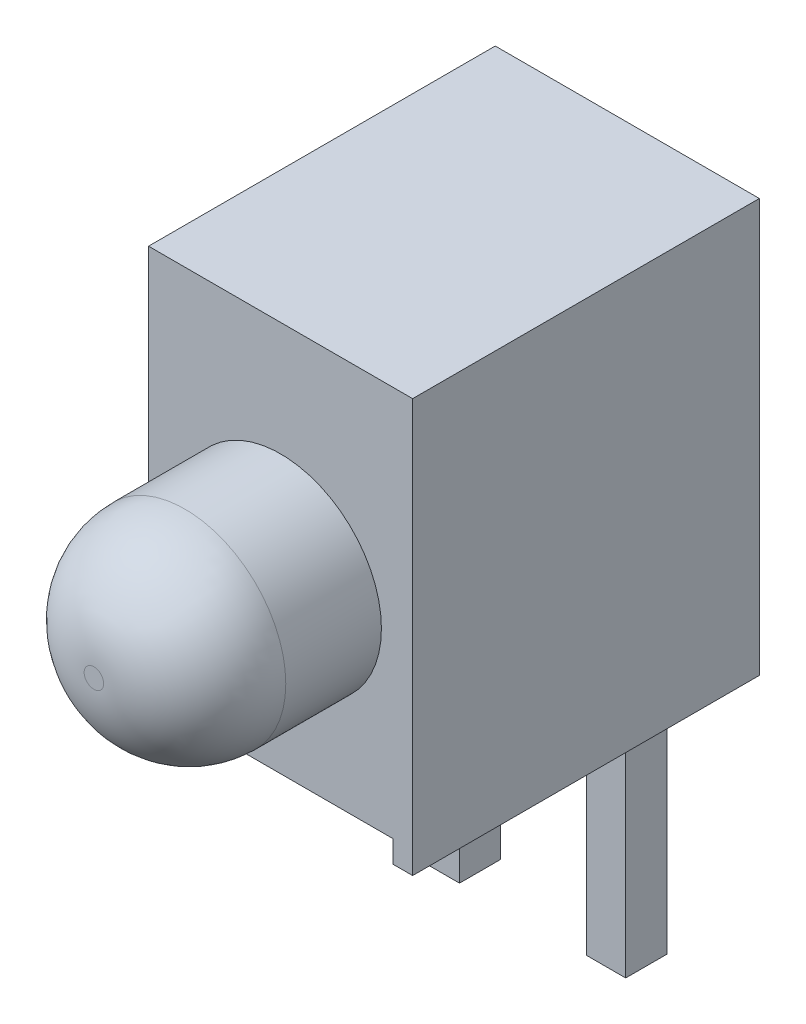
ISO-10303-21;
HEADER;
FILE_DESCRIPTION(('STEP AP214'),'2;1');
FILE_NAME('part.step','',(''),(''),'','','');
FILE_SCHEMA(('AUTOMOTIVE_DESIGN { 1 0 10303 214 1 1 1 1 }'));
ENDSEC;
DATA;
#1=APPLICATION_CONTEXT('core data for automotive mechanical design processes');
#2=APPLICATION_PROTOCOL_DEFINITION('international standard','automotive_design',2000,#1);
#3=PRODUCT_CONTEXT('',#1,'mechanical');
#4=PRODUCT('Part','Part','',(#3));
#5=PRODUCT_RELATED_PRODUCT_CATEGORY('part','',(#4));
#6=PRODUCT_DEFINITION_FORMATION('','',#4);
#7=PRODUCT_DEFINITION_CONTEXT('part definition',#1,'design');
#8=PRODUCT_DEFINITION('design','',#6,#7);
#9=PRODUCT_DEFINITION_SHAPE('','',#8);
#10=(LENGTH_UNIT() NAMED_UNIT(*) SI_UNIT(.MILLI.,.METRE.));
#11=(NAMED_UNIT(*) PLANE_ANGLE_UNIT() SI_UNIT($,.RADIAN.));
#12=(NAMED_UNIT(*) SI_UNIT($,.STERADIAN.) SOLID_ANGLE_UNIT());
#13=UNCERTAINTY_MEASURE_WITH_UNIT(LENGTH_MEASURE(1.E-05),#10,'distance_accuracy_value','');
#14=(GEOMETRIC_REPRESENTATION_CONTEXT(3) GLOBAL_UNCERTAINTY_ASSIGNED_CONTEXT((#13)) GLOBAL_UNIT_ASSIGNED_CONTEXT((#10,
#11,#12)) REPRESENTATION_CONTEXT('',''));
#15=CARTESIAN_POINT('',(0.,0.,0.));
#16=DIRECTION('',(0.,0.,1.));
#17=DIRECTION('',(1.,0.,0.));
#18=AXIS2_PLACEMENT_3D('',#15,#16,#17);
#19=CARTESIAN_POINT('',(-1.76265219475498,0.340679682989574,-2.665));
#20=DIRECTION('',(0.,1.,0.));
#21=DIRECTION('',(0.,0.,1.));
#22=AXIS2_PLACEMENT_3D('',#19,#20,#21);
#23=PLANE('',#22);
#24=DIRECTION('',(0.,0.,1.));
#25=VECTOR('',#24,1.);
#26=CARTESIAN_POINT('',(-0.978193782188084,0.340679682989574,-1.06361068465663));
#27=LINE('',#26,#25);
#28=CARTESIAN_POINT('',(-0.978193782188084,0.340679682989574,-1.69638974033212));
#29=VERTEX_POINT('',#28);
#30=CARTESIAN_POINT('',(-0.978193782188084,0.340679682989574,-1.06361068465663));
#31=VERTEX_POINT('',#30);
#32=EDGE_CURVE('E166',#29,#31,#27,.T.);
#33=ORIENTED_EDGE('',*,*,#32,.F.);
#34=DIRECTION('',(1.,0.,0.));
#35=VECTOR('',#34,1.);
#36=CARTESIAN_POINT('',(-1.57819378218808,0.340679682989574,-1.69638974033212));
#37=LINE('',#36,#35);
#38=CARTESIAN_POINT('',(-1.57819378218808,0.340679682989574,-1.69638974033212));
#39=VERTEX_POINT('',#38);
#40=EDGE_CURVE('E179',#39,#29,#37,.T.);
#41=ORIENTED_EDGE('',*,*,#40,.F.);
#42=DIRECTION('',(0.,0.,-1.));
#43=VECTOR('',#42,1.);
#44=CARTESIAN_POINT('',(-1.57819378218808,0.340679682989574,-1.06361068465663));
#45=LINE('',#44,#43);
#46=CARTESIAN_POINT('',(-1.57819378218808,0.340679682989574,-1.06361068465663));
#47=VERTEX_POINT('',#46);
#48=EDGE_CURVE('E188',#47,#39,#45,.T.);
#49=ORIENTED_EDGE('',*,*,#48,.F.);
#50=DIRECTION('',(-1.,0.,0.));
#51=VECTOR('',#50,1.);
#52=CARTESIAN_POINT('',(-1.57819378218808,0.340679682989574,-1.06361068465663));
#53=LINE('',#52,#51);
#54=EDGE_CURVE('E169',#31,#47,#53,.T.);
#55=ORIENTED_EDGE('',*,*,#54,.F.);
#56=EDGE_LOOP('',(#33,#41,#49,#55));
#57=FACE_BOUND('',#56,.T.);
#58=DIRECTION('',(-1.,0.,0.));
#59=VECTOR('',#58,1.);
#60=CARTESIAN_POINT('',(-1.76265219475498,0.340679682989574,2.665));
#61=LINE('',#60,#59);
#62=CARTESIAN_POINT('',(1.73117626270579,0.340679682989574,2.665));
#63=VERTEX_POINT('',#62);
#64=CARTESIAN_POINT('',(-1.76265219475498,0.340679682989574,2.665));
#65=VERTEX_POINT('',#64);
#66=EDGE_CURVE('E209',#63,#65,#61,.T.);
#67=ORIENTED_EDGE('',*,*,#66,.T.);
#68=DIRECTION('',(0.,0.,1.));
#69=VECTOR('',#68,1.);
#70=CARTESIAN_POINT('',(-1.76265219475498,0.340679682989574,-2.665));
#71=LINE('',#70,#69);
#72=CARTESIAN_POINT('',(-1.76265219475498,0.340679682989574,-2.665));
#73=VERTEX_POINT('',#72);
#74=EDGE_CURVE('E222',#73,#65,#71,.T.);
#75=ORIENTED_EDGE('',*,*,#74,.F.);
#76=DIRECTION('',(-1.,0.,0.));
#77=VECTOR('',#76,1.);
#78=CARTESIAN_POINT('',(-1.76265219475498,0.340679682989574,-2.665));
#79=LINE('',#78,#77);
#80=CARTESIAN_POINT('',(1.73117626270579,0.340679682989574,-2.665));
#81=VERTEX_POINT('',#80);
#82=EDGE_CURVE('E212',#81,#73,#79,.T.);
#83=ORIENTED_EDGE('',*,*,#82,.F.);
#84=DIRECTION('',(0.,0.,1.));
#85=VECTOR('',#84,1.);
#86=CARTESIAN_POINT('',(1.73117626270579,0.340679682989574,-2.665));
#87=LINE('',#86,#85);
#88=EDGE_CURVE('E225',#81,#63,#87,.T.);
#89=ORIENTED_EDGE('',*,*,#88,.T.);
#90=EDGE_LOOP('',(#67,#75,#83,#89));
#91=FACE_BOUND('',#90,.T.);
#92=DIRECTION('',(0.,0.,1.));
#93=VECTOR('',#92,1.);
#94=CARTESIAN_POINT('',(1.56180621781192,0.340679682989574,-1.07861047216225));
#95=LINE('',#94,#93);
#96=CARTESIAN_POINT('',(1.56180621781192,0.340679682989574,-1.71138952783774));
#97=VERTEX_POINT('',#96);
#98=CARTESIAN_POINT('',(1.56180621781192,0.340679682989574,-1.07861047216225));
#99=VERTEX_POINT('',#98);
#100=EDGE_CURVE('E165',#97,#99,#95,.T.);
#101=ORIENTED_EDGE('',*,*,#100,.F.);
#102=DIRECTION('',(1.,0.,0.));
#103=VECTOR('',#102,1.);
#104=CARTESIAN_POINT('',(0.961806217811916,0.340679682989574,-1.71138952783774));
#105=LINE('',#104,#103);
#106=CARTESIAN_POINT('',(0.961806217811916,0.340679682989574,-1.71138952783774));
#107=VERTEX_POINT('',#106);
#108=EDGE_CURVE('E162',#107,#97,#105,.T.);
#109=ORIENTED_EDGE('',*,*,#108,.F.);
#110=DIRECTION('',(0.,0.,-1.));
#111=VECTOR('',#110,1.);
#112=CARTESIAN_POINT('',(0.961806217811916,0.340679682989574,-1.07861047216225));
#113=LINE('',#112,#111);
#114=CARTESIAN_POINT('',(0.961806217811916,0.340679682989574,-1.07861047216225));
#115=VERTEX_POINT('',#114);
#116=EDGE_CURVE('E52',#115,#107,#113,.T.);
#117=ORIENTED_EDGE('',*,*,#116,.F.);
#118=DIRECTION('',(-1.,0.,0.));
#119=VECTOR('',#118,1.);
#120=CARTESIAN_POINT('',(0.961806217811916,0.340679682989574,-1.07861047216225));
#121=LINE('',#120,#119);
#122=EDGE_CURVE('E47',#99,#115,#121,.T.);
#123=ORIENTED_EDGE('',*,*,#122,.F.);
#124=EDGE_LOOP('',(#101,#109,#117,#123));
#125=FACE_BOUND('',#124,.T.);
#126=ADVANCED_FACE('F32',(#57,#91,#125),#23,.F.);
#127=CARTESIAN_POINT('',(2.03,0.,2.665));
#128=DIRECTION('',(0.,1.,0.));
#129=DIRECTION('',(0.,0.,1.));
#130=AXIS2_PLACEMENT_3D('',#127,#128,#129);
#131=PLANE('',#130);
#132=DIRECTION('',(-1.,0.,0.));
#133=VECTOR('',#132,1.);
#134=CARTESIAN_POINT('',(-2.03,0.,-2.665));
#135=LINE('',#134,#133);
#136=CARTESIAN_POINT('',(-1.76265219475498,0.,-2.665));
#137=VERTEX_POINT('',#136);
#138=CARTESIAN_POINT('',(-2.03,0.,-2.665));
#139=VERTEX_POINT('',#138);
#140=EDGE_CURVE('E244',#137,#139,#135,.T.);
#141=ORIENTED_EDGE('',*,*,#140,.F.);
#142=DIRECTION('',(0.,0.,1.));
#143=VECTOR('',#142,1.);
#144=CARTESIAN_POINT('',(-1.76265219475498,0.,-2.665));
#145=LINE('',#144,#143);
#146=CARTESIAN_POINT('',(-1.76265219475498,0.,2.665));
#147=VERTEX_POINT('',#146);
#148=EDGE_CURVE('E215',#137,#147,#145,.T.);
#149=ORIENTED_EDGE('',*,*,#148,.T.);
#150=DIRECTION('',(1.,0.,0.));
#151=VECTOR('',#150,1.);
#152=CARTESIAN_POINT('',(-2.03,0.,2.665));
#153=LINE('',#152,#151);
#154=CARTESIAN_POINT('',(-2.03,0.,2.665));
#155=VERTEX_POINT('',#154);
#156=EDGE_CURVE('E235',#155,#147,#153,.T.);
#157=ORIENTED_EDGE('',*,*,#156,.F.);
#158=DIRECTION('',(0.,0.,1.));
#159=VECTOR('',#158,1.);
#160=CARTESIAN_POINT('',(-2.03,0.,-2.665));
#161=LINE('',#160,#159);
#162=EDGE_CURVE('E248',#139,#155,#161,.T.);
#163=ORIENTED_EDGE('',*,*,#162,.F.);
#164=EDGE_LOOP('',(#141,#149,#157,#163));
#165=FACE_BOUND('',#164,.T.);
#166=ADVANCED_FACE('F285',(#165),#131,.F.);
#167=CARTESIAN_POINT('',(-2.03,6.35,2.665));
#168=DIRECTION('',(0.,0.,-1.));
#169=DIRECTION('',(-1.,0.,0.));
#170=AXIS2_PLACEMENT_3D('',#167,#168,#169);
#171=PLANE('',#170);
#172=ORIENTED_EDGE('',*,*,#156,.T.);
#173=DIRECTION('',(0.,-1.,0.));
#174=VECTOR('',#173,1.);
#175=CARTESIAN_POINT('',(-1.76265219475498,0.,2.665));
#176=LINE('',#175,#174);
#177=EDGE_CURVE('E204',#65,#147,#176,.T.);
#178=ORIENTED_EDGE('',*,*,#177,.F.);
#179=ORIENTED_EDGE('',*,*,#66,.F.);
#180=DIRECTION('',(0.,1.,0.));
#181=VECTOR('',#180,1.);
#182=CARTESIAN_POINT('',(1.73117626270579,0.,2.665));
#183=LINE('',#182,#181);
#184=CARTESIAN_POINT('',(1.73117626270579,0.,2.665));
#185=VERTEX_POINT('',#184);
#186=EDGE_CURVE('E217',#185,#63,#183,.T.);
#187=ORIENTED_EDGE('',*,*,#186,.F.);
#188=CARTESIAN_POINT('',(2.03,0.,2.665));
#189=VERTEX_POINT('',#188);
#190=EDGE_CURVE('E250',#185,#189,#153,.T.);
#191=ORIENTED_EDGE('',*,*,#190,.T.);
#192=DIRECTION('',(0.,-1.,0.));
#193=VECTOR('',#192,1.);
#194=CARTESIAN_POINT('',(2.03,6.35,2.665));
#195=LINE('',#194,#193);
#196=CARTESIAN_POINT('',(2.03,6.35,2.665));
#197=VERTEX_POINT('',#196);
#198=EDGE_CURVE('E241',#197,#189,#195,.T.);
#199=ORIENTED_EDGE('',*,*,#198,.F.);
#200=DIRECTION('',(1.,0.,0.));
#201=VECTOR('',#200,1.);
#202=CARTESIAN_POINT('',(-2.03,6.35,2.665));
#203=LINE('',#202,#201);
#204=CARTESIAN_POINT('',(-2.03,6.35,2.665));
#205=VERTEX_POINT('',#204);
#206=EDGE_CURVE('E239',#205,#197,#203,.T.);
#207=ORIENTED_EDGE('',*,*,#206,.F.);
#208=DIRECTION('',(0.,-1.,0.));
#209=VECTOR('',#208,1.);
#210=CARTESIAN_POINT('',(-2.03,6.35,2.665));
#211=LINE('',#210,#209);
#212=EDGE_CURVE('E255',#205,#155,#211,.T.);
#213=ORIENTED_EDGE('',*,*,#212,.T.);
#214=EDGE_LOOP('',(#172,#178,#179,#187,#191,#199,#207,#213));
#215=FACE_BOUND('',#214,.T.);
#216=CARTESIAN_POINT('',(0.,3.05,2.665));
#217=DIRECTION('',(0.,0.,-1.));
#218=DIRECTION('',(-1.,0.,0.));
#219=AXIS2_PLACEMENT_3D('',#216,#217,#218);
#220=CIRCLE('',#219,1.55);
#221=CARTESIAN_POINT('',(-1.55,3.05,2.665));
#222=VERTEX_POINT('',#221);
#223=EDGE_CURVE('E264',#222,#222,#220,.F.);
#224=ORIENTED_EDGE('',*,*,#223,.F.);
#225=EDGE_LOOP('',(#224));
#226=FACE_BOUND('',#225,.T.);
#227=ADVANCED_FACE('F291',(#215,#226),#171,.F.);
#228=CARTESIAN_POINT('',(2.03,6.35,-2.665));
#229=DIRECTION('',(-1.,0.,0.));
#230=DIRECTION('',(0.,0.,1.));
#231=AXIS2_PLACEMENT_3D('',#228,#229,#230);
#232=PLANE('',#231);
#233=DIRECTION('',(0.,0.,-1.));
#234=VECTOR('',#233,1.);
#235=CARTESIAN_POINT('',(2.03,0.,-2.665));
#236=LINE('',#235,#234);
#237=CARTESIAN_POINT('',(2.03,0.,-2.665));
#238=VERTEX_POINT('',#237);
#239=EDGE_CURVE('E224',#189,#238,#236,.T.);
#240=ORIENTED_EDGE('',*,*,#239,.T.);
#241=DIRECTION('',(0.,-1.,0.));
#242=VECTOR('',#241,1.);
#243=CARTESIAN_POINT('',(2.03,6.35,-2.665));
#244=LINE('',#243,#242);
#245=CARTESIAN_POINT('',(2.03,6.35,-2.665));
#246=VERTEX_POINT('',#245);
#247=EDGE_CURVE('E261',#246,#238,#244,.T.);
#248=ORIENTED_EDGE('',*,*,#247,.F.);
#249=DIRECTION('',(0.,0.,-1.));
#250=VECTOR('',#249,1.);
#251=CARTESIAN_POINT('',(2.03,6.35,-2.665));
#252=LINE('',#251,#250);
#253=EDGE_CURVE('E231',#197,#246,#252,.T.);
#254=ORIENTED_EDGE('',*,*,#253,.F.);
#255=ORIENTED_EDGE('',*,*,#198,.T.);
#256=EDGE_LOOP('',(#240,#248,#254,#255));
#257=FACE_BOUND('',#256,.T.);
#258=ADVANCED_FACE('F315',(#257),#232,.F.);
#259=CARTESIAN_POINT('',(-2.03,6.35,-2.665));
#260=DIRECTION('',(0.,0.,1.));
#261=DIRECTION('',(1.,0.,0.));
#262=AXIS2_PLACEMENT_3D('',#259,#260,#261);
#263=PLANE('',#262);
#264=ORIENTED_EDGE('',*,*,#82,.T.);
#265=DIRECTION('',(0.,-1.,0.));
#266=VECTOR('',#265,1.);
#267=CARTESIAN_POINT('',(-1.76265219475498,0.,-2.665));
#268=LINE('',#267,#266);
#269=EDGE_CURVE('E205',#73,#137,#268,.T.);
#270=ORIENTED_EDGE('',*,*,#269,.T.);
#271=ORIENTED_EDGE('',*,*,#140,.T.);
#272=DIRECTION('',(0.,-1.,0.));
#273=VECTOR('',#272,1.);
#274=CARTESIAN_POINT('',(-2.03,6.35,-2.665));
#275=LINE('',#274,#273);
#276=CARTESIAN_POINT('',(-2.03,6.35,-2.665));
#277=VERTEX_POINT('',#276);
#278=EDGE_CURVE('E258',#277,#139,#275,.T.);
#279=ORIENTED_EDGE('',*,*,#278,.F.);
#280=DIRECTION('',(-1.,0.,0.));
#281=VECTOR('',#280,1.);
#282=CARTESIAN_POINT('',(-2.03,6.35,-2.665));
#283=LINE('',#282,#281);
#284=EDGE_CURVE('E234',#246,#277,#283,.T.);
#285=ORIENTED_EDGE('',*,*,#284,.F.);
#286=ORIENTED_EDGE('',*,*,#247,.T.);
#287=CARTESIAN_POINT('',(1.73117626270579,0.,-2.665));
#288=VERTEX_POINT('',#287);
#289=EDGE_CURVE('E245',#238,#288,#135,.T.);
#290=ORIENTED_EDGE('',*,*,#289,.T.);
#291=DIRECTION('',(0.,1.,0.));
#292=VECTOR('',#291,1.);
#293=CARTESIAN_POINT('',(1.73117626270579,0.,-2.665));
#294=LINE('',#293,#292);
#295=EDGE_CURVE('E208',#288,#81,#294,.T.);
#296=ORIENTED_EDGE('',*,*,#295,.T.);
#297=EDGE_LOOP('',(#264,#270,#271,#279,#285,#286,#290,#296));
#298=FACE_BOUND('',#297,.T.);
#299=ADVANCED_FACE('F319',(#298),#263,.F.);
#300=CARTESIAN_POINT('',(-2.03,6.35,-2.665));
#301=DIRECTION('',(1.,0.,0.));
#302=DIRECTION('',(0.,0.,-1.));
#303=AXIS2_PLACEMENT_3D('',#300,#301,#302);
#304=PLANE('',#303);
#305=ORIENTED_EDGE('',*,*,#162,.T.);
#306=ORIENTED_EDGE('',*,*,#212,.F.);
#307=DIRECTION('',(0.,0.,1.));
#308=VECTOR('',#307,1.);
#309=CARTESIAN_POINT('',(-2.03,6.35,-2.665));
#310=LINE('',#309,#308);
#311=EDGE_CURVE('E237',#277,#205,#310,.T.);
#312=ORIENTED_EDGE('',*,*,#311,.F.);
#313=ORIENTED_EDGE('',*,*,#278,.T.);
#314=EDGE_LOOP('',(#305,#306,#312,#313));
#315=FACE_BOUND('',#314,.T.);
#316=ADVANCED_FACE('F308',(#315),#304,.F.);
#317=CARTESIAN_POINT('',(2.03,6.35,2.665));
#318=DIRECTION('',(0.,1.,0.));
#319=DIRECTION('',(0.,0.,1.));
#320=AXIS2_PLACEMENT_3D('',#317,#318,#319);
#321=PLANE('',#320);
#322=ORIENTED_EDGE('',*,*,#253,.T.);
#323=ORIENTED_EDGE('',*,*,#284,.T.);
#324=ORIENTED_EDGE('',*,*,#311,.T.);
#325=ORIENTED_EDGE('',*,*,#206,.T.);
#326=EDGE_LOOP('',(#322,#323,#324,#325));
#327=FACE_BOUND('',#326,.T.);
#328=ADVANCED_FACE('F306',(#327),#321,.T.);
#329=ORIENTED_EDGE('',*,*,#190,.F.);
#330=DIRECTION('',(0.,0.,1.));
#331=VECTOR('',#330,1.);
#332=CARTESIAN_POINT('',(1.73117626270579,0.,-2.665));
#333=LINE('',#332,#331);
#334=EDGE_CURVE('E227',#288,#185,#333,.T.);
#335=ORIENTED_EDGE('',*,*,#334,.F.);
#336=ORIENTED_EDGE('',*,*,#289,.F.);
#337=ORIENTED_EDGE('',*,*,#239,.F.);
#338=EDGE_LOOP('',(#329,#335,#336,#337));
#339=FACE_BOUND('',#338,.T.);
#340=ADVANCED_FACE('F294',(#339),#131,.F.);
#341=CARTESIAN_POINT('',(0.,3.05,5.5352));
#342=DIRECTION('',(0.,0.,-1.));
#343=DIRECTION('',(-1.,0.,0.));
#344=AXIS2_PLACEMENT_3D('',#341,#342,#343);
#345=CYLINDRICAL_SURFACE('',#344,1.55);
#346=CARTESIAN_POINT('',(0.,3.05,4.1352));
#347=DIRECTION('',(0.,0.,1.));
#348=DIRECTION('',(1.,0.,0.));
#349=AXIS2_PLACEMENT_3D('',#346,#347,#348);
#350=CIRCLE('',#349,1.55);
#351=CARTESIAN_POINT('',(-1.55,3.05,4.1352));
#352=VERTEX_POINT('',#351);
#353=EDGE_CURVE('E11',#352,#352,#350,.F.);
#354=CARTESIAN_POINT('',(-1.55,3.05,4.1352));
#355=CARTESIAN_POINT('',(-1.55,3.05,4.11988541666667));
#356=CARTESIAN_POINT('',(-1.55,3.05,4.10457083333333));
#357=CARTESIAN_POINT('',(-1.55,3.05,4.07394166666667));
#358=CARTESIAN_POINT('',(-1.55,3.05,4.05862708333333));
#359=CARTESIAN_POINT('',(-1.55,3.05,4.02799791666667));
#360=CARTESIAN_POINT('',(-1.55,3.05,4.01268333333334));
#361=CARTESIAN_POINT('',(-1.55,3.05,3.98205416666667));
#362=CARTESIAN_POINT('',(-1.55,3.05,3.96673958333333));
#363=CARTESIAN_POINT('',(-1.55,3.05,3.93611041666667));
#364=CARTESIAN_POINT('',(-1.55,3.05,3.92079583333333));
#365=CARTESIAN_POINT('',(-1.55,3.05,3.89016666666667));
#366=CARTESIAN_POINT('',(-1.55,3.05,3.87485208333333));
#367=CARTESIAN_POINT('',(-1.55,3.05,3.84422291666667));
#368=CARTESIAN_POINT('',(-1.55,3.05,3.82890833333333));
#369=CARTESIAN_POINT('',(-1.55,3.05,3.79827916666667));
#370=CARTESIAN_POINT('',(-1.55,3.05,3.78296458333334));
#371=CARTESIAN_POINT('',(-1.55,3.05,3.75233541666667));
#372=CARTESIAN_POINT('',(-1.55,3.05,3.73702083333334));
#373=CARTESIAN_POINT('',(-1.55,3.05,3.70639166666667));
#374=CARTESIAN_POINT('',(-1.55,3.05,3.69107708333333));
#375=CARTESIAN_POINT('',(-1.55,3.05,3.66044791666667));
#376=CARTESIAN_POINT('',(-1.55,3.05,3.64513333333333));
#377=CARTESIAN_POINT('',(-1.55,3.05,3.61450416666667));
#378=CARTESIAN_POINT('',(-1.55,3.05,3.59918958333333));
#379=CARTESIAN_POINT('',(-1.55,3.05,3.56856041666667));
#380=CARTESIAN_POINT('',(-1.55,3.05,3.55324583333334));
#381=CARTESIAN_POINT('',(-1.55,3.05,3.52261666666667));
#382=CARTESIAN_POINT('',(-1.55,3.05,3.50730208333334));
#383=CARTESIAN_POINT('',(-1.55,3.05,3.47667291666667));
#384=CARTESIAN_POINT('',(-1.55,3.05,3.46135833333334));
#385=CARTESIAN_POINT('',(-1.55,3.05,3.43072916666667));
#386=CARTESIAN_POINT('',(-1.55,3.05,3.41541458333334));
#387=CARTESIAN_POINT('',(-1.55,3.05,3.38478541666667));
#388=CARTESIAN_POINT('',(-1.55,3.05,3.36947083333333));
#389=CARTESIAN_POINT('',(-1.55,3.05,3.33884166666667));
#390=CARTESIAN_POINT('',(-1.55,3.05,3.32352708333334));
#391=CARTESIAN_POINT('',(-1.55,3.05,3.29289791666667));
#392=CARTESIAN_POINT('',(-1.55,3.05,3.27758333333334));
#393=CARTESIAN_POINT('',(-1.55,3.05,3.24695416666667));
#394=CARTESIAN_POINT('',(-1.55,3.05,3.23163958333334));
#395=CARTESIAN_POINT('',(-1.55,3.05,3.20101041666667));
#396=CARTESIAN_POINT('',(-1.55,3.05,3.18569583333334));
#397=CARTESIAN_POINT('',(-1.55,3.05,3.15506666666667));
#398=CARTESIAN_POINT('',(-1.55,3.05,3.13975208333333));
#399=CARTESIAN_POINT('',(-1.55,3.05,3.10912291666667));
#400=CARTESIAN_POINT('',(-1.55,3.05,3.09380833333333));
#401=CARTESIAN_POINT('',(-1.55,3.05,3.06317916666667));
#402=CARTESIAN_POINT('',(-1.55,3.05,3.04786458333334));
#403=CARTESIAN_POINT('',(-1.55,3.05,3.01723541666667));
#404=CARTESIAN_POINT('',(-1.55,3.05,3.00192083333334));
#405=CARTESIAN_POINT('',(-1.55,3.05,2.97129166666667));
#406=CARTESIAN_POINT('',(-1.55,3.05,2.95597708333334));
#407=CARTESIAN_POINT('',(-1.55,3.05,2.92534791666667));
#408=CARTESIAN_POINT('',(-1.55,3.05,2.91003333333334));
#409=CARTESIAN_POINT('',(-1.55,3.05,2.87940416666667));
#410=CARTESIAN_POINT('',(-1.55,3.05,2.86408958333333));
#411=CARTESIAN_POINT('',(-1.55,3.05,2.83346041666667));
#412=CARTESIAN_POINT('',(-1.55,3.05,2.81814583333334));
#413=CARTESIAN_POINT('',(-1.55,3.05,2.78751666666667));
#414=CARTESIAN_POINT('',(-1.55,3.05,2.77220208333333));
#415=CARTESIAN_POINT('',(-1.55,3.05,2.74157291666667));
#416=CARTESIAN_POINT('',(-1.55,3.05,2.72625833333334));
#417=CARTESIAN_POINT('',(-1.55,3.05,2.69562916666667));
#418=CARTESIAN_POINT('',(-1.55,3.05,2.68031458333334));
#419=CARTESIAN_POINT('',(-1.55,3.05,2.665));
#420=B_SPLINE_CURVE_WITH_KNOTS('',3,(#354,#355,#356,#357,#358,#359,#360,#361,#362,#363,#364,
#365,#366,#367,#368,#369,#370,#371,#372,#373,#374,#375,#376,#377,#378,#379,#380,#381,#382,#383,
#384,#385,#386,#387,#388,#389,#390,#391,#392,#393,#394,#395,#396,#397,#398,#399,#400,#401,#402,
#403,#404,#405,#406,#407,#408,#409,#410,#411,#412,#413,#414,#415,#416,#417,#418,#419),
.UNSPECIFIED.,.F.,.F.,(4,2,2,2,2,2,2,2,2,2,2,2,2,2,2,2,2,2,2,2,2,2,2,2,2,2,2,2,2,2,2,2,4),(0.,
0.0459437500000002,0.0918874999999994,0.13783125,0.183775,0.22971875,0.2756625,0.32160625,
0.367549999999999,0.41349375,0.4594375,0.50538125,0.551325,0.597268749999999,0.6432125,
0.689156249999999,0.735099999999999,0.781043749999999,0.826987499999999,0.872931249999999,
0.918874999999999,0.964818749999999,1.0107625,1.05670625,1.10265,1.14859375,1.1945375,
1.24048125,1.286425,1.33236875,1.3783125,1.42425625,1.4702),.UNSPECIFIED.);
#421=EDGE_CURVE('BSEAM281',#352,#222,#420,.T.);
#422=ORIENTED_EDGE('',*,*,#353,.T.);
#423=ORIENTED_EDGE('',*,*,#223,.T.);
#424=ORIENTED_EDGE('',*,*,#421,.T.);
#425=ORIENTED_EDGE('',*,*,#421,.F.);
#426=EDGE_LOOP('',(#422,#424,#423,#425));
#427=FACE_BOUND('',#426,.T.);
#428=ADVANCED_FACE('F281',(#427),#345,.T.);
#429=CARTESIAN_POINT('',(0.,3.05,5.5352));
#430=DIRECTION('',(0.,0.,1.));
#431=DIRECTION('',(1.,0.,0.));
#432=AXIS2_PLACEMENT_3D('',#429,#430,#431);
#433=PLANE('',#432);
#434=CARTESIAN_POINT('',(0.,3.05,5.5352));
#435=DIRECTION('',(0.,0.,1.));
#436=DIRECTION('',(1.,0.,0.));
#437=AXIS2_PLACEMENT_3D('',#434,#435,#436);
#438=CIRCLE('',#437,0.15);
#439=CARTESIAN_POINT('',(0.15,3.05,5.5352));
#440=VERTEX_POINT('',#439);
#441=EDGE_CURVE('E40',#440,#440,#438,.T.);
#442=ORIENTED_EDGE('',*,*,#441,.T.);
#443=EDGE_LOOP('',(#442));
#444=FACE_BOUND('',#443,.T.);
#445=ADVANCED_FACE('F269',(#444),#433,.T.);
#446=CARTESIAN_POINT('',(0.,3.05,4.1352));
#447=DIRECTION('',(0.,0.,1.));
#448=DIRECTION('',(1.,0.,0.));
#449=AXIS2_PLACEMENT_3D('',#446,#447,#448);
#450=DEGENERATE_TOROIDAL_SURFACE('',#449,0.15,1.4,.T.);
#451=ORIENTED_EDGE('',*,*,#353,.F.);
#452=EDGE_LOOP('',(#451));
#453=FACE_BOUND('',#452,.T.);
#454=ORIENTED_EDGE('',*,*,#441,.F.);
#455=EDGE_LOOP('',(#454));
#456=FACE_BOUND('',#455,.T.);
#457=ADVANCED_FACE('F34',(#453,#456),#450,.T.);
#458=CARTESIAN_POINT('',(-1.76265219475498,0.,-2.665));
#459=DIRECTION('',(-1.,0.,0.));
#460=DIRECTION('',(0.,0.,1.));
#461=AXIS2_PLACEMENT_3D('',#458,#459,#460);
#462=PLANE('',#461);
#463=ORIENTED_EDGE('',*,*,#177,.T.);
#464=ORIENTED_EDGE('',*,*,#148,.F.);
#465=ORIENTED_EDGE('',*,*,#269,.F.);
#466=ORIENTED_EDGE('',*,*,#74,.T.);
#467=EDGE_LOOP('',(#463,#464,#465,#466));
#468=FACE_BOUND('',#467,.T.);
#469=ADVANCED_FACE('F272',(#468),#462,.F.);
#470=CARTESIAN_POINT('',(1.73117626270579,0.,-2.665));
#471=DIRECTION('',(1.,0.,0.));
#472=DIRECTION('',(0.,0.,-1.));
#473=AXIS2_PLACEMENT_3D('',#470,#471,#472);
#474=PLANE('',#473);
#475=ORIENTED_EDGE('',*,*,#186,.T.);
#476=ORIENTED_EDGE('',*,*,#88,.F.);
#477=ORIENTED_EDGE('',*,*,#295,.F.);
#478=ORIENTED_EDGE('',*,*,#334,.T.);
#479=EDGE_LOOP('',(#475,#476,#477,#478));
#480=FACE_BOUND('',#479,.T.);
#481=ADVANCED_FACE('F278',(#480),#474,.F.);
#482=CARTESIAN_POINT('',(-0.978193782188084,-3.46932031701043,-1.06361068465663));
#483=DIRECTION('',(-1.,0.,0.));
#484=DIRECTION('',(0.,0.,1.));
#485=AXIS2_PLACEMENT_3D('',#482,#483,#484);
#486=PLANE('',#485);
#487=ORIENTED_EDGE('',*,*,#32,.T.);
#488=DIRECTION('',(0.,1.,0.));
#489=VECTOR('',#488,1.);
#490=CARTESIAN_POINT('',(-0.978193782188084,-3.46932031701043,-1.06361068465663));
#491=LINE('',#490,#489);
#492=CARTESIAN_POINT('',(-0.978193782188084,-3.46932031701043,-1.06361068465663));
#493=VERTEX_POINT('',#492);
#494=EDGE_CURVE('E201',#493,#31,#491,.T.);
#495=ORIENTED_EDGE('',*,*,#494,.F.);
#496=DIRECTION('',(0.,0.,1.));
#497=VECTOR('',#496,1.);
#498=CARTESIAN_POINT('',(-0.978193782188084,-3.46932031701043,-1.06361068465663));
#499=LINE('',#498,#497);
#500=CARTESIAN_POINT('',(-0.978193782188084,-3.46932031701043,-1.69638974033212));
#501=VERTEX_POINT('',#500);
#502=EDGE_CURVE('E175',#501,#493,#499,.T.);
#503=ORIENTED_EDGE('',*,*,#502,.F.);
#504=DIRECTION('',(0.,1.,0.));
#505=VECTOR('',#504,1.);
#506=CARTESIAN_POINT('',(-0.978193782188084,-3.46932031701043,-1.69638974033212));
#507=LINE('',#506,#505);
#508=EDGE_CURVE('E184',#501,#29,#507,.T.);
#509=ORIENTED_EDGE('',*,*,#508,.T.);
#510=EDGE_LOOP('',(#487,#495,#503,#509));
#511=FACE_BOUND('',#510,.T.);
#512=ADVANCED_FACE('F298',(#511),#486,.F.);
#513=CARTESIAN_POINT('',(-1.57819378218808,-3.46932031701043,-1.06361068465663));
#514=DIRECTION('',(0.,0.,-1.));
#515=DIRECTION('',(-1.,0.,0.));
#516=AXIS2_PLACEMENT_3D('',#513,#514,#515);
#517=PLANE('',#516);
#518=ORIENTED_EDGE('',*,*,#54,.T.);
#519=DIRECTION('',(0.,1.,0.));
#520=VECTOR('',#519,1.);
#521=CARTESIAN_POINT('',(-1.57819378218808,-3.46932031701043,-1.06361068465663));
#522=LINE('',#521,#520);
#523=CARTESIAN_POINT('',(-1.57819378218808,-3.46932031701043,-1.06361068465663));
#524=VERTEX_POINT('',#523);
#525=EDGE_CURVE('E198',#524,#47,#522,.T.);
#526=ORIENTED_EDGE('',*,*,#525,.F.);
#527=DIRECTION('',(-1.,0.,0.));
#528=VECTOR('',#527,1.);
#529=CARTESIAN_POINT('',(-1.57819378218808,-3.46932031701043,-1.06361068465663));
#530=LINE('',#529,#528);
#531=EDGE_CURVE('E178',#493,#524,#530,.T.);
#532=ORIENTED_EDGE('',*,*,#531,.F.);
#533=ORIENTED_EDGE('',*,*,#494,.T.);
#534=EDGE_LOOP('',(#518,#526,#532,#533));
#535=FACE_BOUND('',#534,.T.);
#536=ADVANCED_FACE('F383',(#535),#517,.F.);
#537=CARTESIAN_POINT('',(-1.57819378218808,-3.46932031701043,-1.06361068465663));
#538=DIRECTION('',(1.,0.,0.));
#539=DIRECTION('',(0.,0.,-1.));
#540=AXIS2_PLACEMENT_3D('',#537,#538,#539);
#541=PLANE('',#540);
#542=ORIENTED_EDGE('',*,*,#48,.T.);
#543=DIRECTION('',(0.,1.,0.));
#544=VECTOR('',#543,1.);
#545=CARTESIAN_POINT('',(-1.57819378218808,-3.46932031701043,-1.69638974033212));
#546=LINE('',#545,#544);
#547=CARTESIAN_POINT('',(-1.57819378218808,-3.46932031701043,-1.69638974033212));
#548=VERTEX_POINT('',#547);
#549=EDGE_CURVE('E195',#548,#39,#546,.T.);
#550=ORIENTED_EDGE('',*,*,#549,.F.);
#551=DIRECTION('',(0.,0.,-1.));
#552=VECTOR('',#551,1.);
#553=CARTESIAN_POINT('',(-1.57819378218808,-3.46932031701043,-1.06361068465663));
#554=LINE('',#553,#552);
#555=EDGE_CURVE('E181',#524,#548,#554,.T.);
#556=ORIENTED_EDGE('',*,*,#555,.F.);
#557=ORIENTED_EDGE('',*,*,#525,.T.);
#558=EDGE_LOOP('',(#542,#550,#556,#557));
#559=FACE_BOUND('',#558,.T.);
#560=ADVANCED_FACE('F380',(#559),#541,.F.);
#561=CARTESIAN_POINT('',(-1.57819378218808,-3.46932031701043,-1.69638974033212));
#562=DIRECTION('',(0.,0.,1.));
#563=DIRECTION('',(1.,0.,0.));
#564=AXIS2_PLACEMENT_3D('',#561,#562,#563);
#565=PLANE('',#564);
#566=ORIENTED_EDGE('',*,*,#40,.T.);
#567=ORIENTED_EDGE('',*,*,#508,.F.);
#568=DIRECTION('',(1.,0.,0.));
#569=VECTOR('',#568,1.);
#570=CARTESIAN_POINT('',(-1.57819378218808,-3.46932031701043,-1.69638974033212));
#571=LINE('',#570,#569);
#572=EDGE_CURVE('E183',#548,#501,#571,.T.);
#573=ORIENTED_EDGE('',*,*,#572,.F.);
#574=ORIENTED_EDGE('',*,*,#549,.T.);
#575=EDGE_LOOP('',(#566,#567,#573,#574));
#576=FACE_BOUND('',#575,.T.);
#577=ADVANCED_FACE('F376',(#576),#565,.F.);
#578=CARTESIAN_POINT('',(-0.978193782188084,-3.46932031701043,-1.69638974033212));
#579=DIRECTION('',(0.,-1.,0.));
#580=DIRECTION('',(0.,0.,-1.));
#581=AXIS2_PLACEMENT_3D('',#578,#579,#580);
#582=PLANE('',#581);
#583=ORIENTED_EDGE('',*,*,#502,.T.);
#584=ORIENTED_EDGE('',*,*,#531,.T.);
#585=ORIENTED_EDGE('',*,*,#555,.T.);
#586=ORIENTED_EDGE('',*,*,#572,.T.);
#587=EDGE_LOOP('',(#583,#584,#585,#586));
#588=FACE_BOUND('',#587,.T.);
#589=ADVANCED_FACE('F373',(#588),#582,.T.);
#590=CARTESIAN_POINT('',(1.56180621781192,-3.46932031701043,-1.07861047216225));
#591=DIRECTION('',(-1.,0.,0.));
#592=DIRECTION('',(0.,0.,1.));
#593=AXIS2_PLACEMENT_3D('',#590,#591,#592);
#594=PLANE('',#593);
#595=ORIENTED_EDGE('',*,*,#100,.T.);
#596=DIRECTION('',(0.,1.,0.));
#597=VECTOR('',#596,1.);
#598=CARTESIAN_POINT('',(1.56180621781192,-3.46932031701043,-1.07861047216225));
#599=LINE('',#598,#597);
#600=CARTESIAN_POINT('',(1.56180621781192,-3.46932031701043,-1.07861047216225));
#601=VERTEX_POINT('',#600);
#602=EDGE_CURVE('E146',#601,#99,#599,.T.);
#603=ORIENTED_EDGE('',*,*,#602,.F.);
#604=DIRECTION('',(0.,0.,1.));
#605=VECTOR('',#604,1.);
#606=CARTESIAN_POINT('',(1.56180621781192,-3.46932031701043,-1.07861047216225));
#607=LINE('',#606,#605);
#608=CARTESIAN_POINT('',(1.56180621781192,-3.46932031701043,-1.71138952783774));
#609=VERTEX_POINT('',#608);
#610=EDGE_CURVE('E153',#609,#601,#607,.T.);
#611=ORIENTED_EDGE('',*,*,#610,.F.);
#612=DIRECTION('',(0.,1.,0.));
#613=VECTOR('',#612,1.);
#614=CARTESIAN_POINT('',(1.56180621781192,-3.46932031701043,-1.71138952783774));
#615=LINE('',#614,#613);
#616=EDGE_CURVE('E351',#609,#97,#615,.T.);
#617=ORIENTED_EDGE('',*,*,#616,.T.);
#618=EDGE_LOOP('',(#595,#603,#611,#617));
#619=FACE_BOUND('',#618,.T.);
#620=ADVANCED_FACE('F164',(#619),#594,.F.);
#621=CARTESIAN_POINT('',(0.961806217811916,-3.46932031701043,-1.07861047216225));
#622=DIRECTION('',(0.,0.,-1.));
#623=DIRECTION('',(-1.,0.,0.));
#624=AXIS2_PLACEMENT_3D('',#621,#622,#623);
#625=PLANE('',#624);
#626=ORIENTED_EDGE('',*,*,#122,.T.);
#627=DIRECTION('',(0.,1.,0.));
#628=VECTOR('',#627,1.);
#629=CARTESIAN_POINT('',(0.961806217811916,-3.46932031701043,-1.07861047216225));
#630=LINE('',#629,#628);
#631=CARTESIAN_POINT('',(0.961806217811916,-3.46932031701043,-1.07861047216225));
#632=VERTEX_POINT('',#631);
#633=EDGE_CURVE('E149',#632,#115,#630,.T.);
#634=ORIENTED_EDGE('',*,*,#633,.F.);
#635=DIRECTION('',(-1.,0.,0.));
#636=VECTOR('',#635,1.);
#637=CARTESIAN_POINT('',(0.961806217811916,-3.46932031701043,-1.07861047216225));
#638=LINE('',#637,#636);
#639=EDGE_CURVE('E142',#601,#632,#638,.T.);
#640=ORIENTED_EDGE('',*,*,#639,.F.);
#641=ORIENTED_EDGE('',*,*,#602,.T.);
#642=EDGE_LOOP('',(#626,#634,#640,#641));
#643=FACE_BOUND('',#642,.T.);
#644=ADVANCED_FACE('F144',(#643),#625,.F.);
#645=CARTESIAN_POINT('',(0.961806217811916,-3.46932031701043,-1.07861047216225));
#646=DIRECTION('',(1.,0.,0.));
#647=DIRECTION('',(0.,0.,-1.));
#648=AXIS2_PLACEMENT_3D('',#645,#646,#647);
#649=PLANE('',#648);
#650=ORIENTED_EDGE('',*,*,#116,.T.);
#651=DIRECTION('',(0.,1.,0.));
#652=VECTOR('',#651,1.);
#653=CARTESIAN_POINT('',(0.961806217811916,-3.46932031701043,-1.71138952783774));
#654=LINE('',#653,#652);
#655=CARTESIAN_POINT('',(0.961806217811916,-3.46932031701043,-1.71138952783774));
#656=VERTEX_POINT('',#655);
#657=EDGE_CURVE('E171',#656,#107,#654,.T.);
#658=ORIENTED_EDGE('',*,*,#657,.F.);
#659=DIRECTION('',(0.,0.,-1.));
#660=VECTOR('',#659,1.);
#661=CARTESIAN_POINT('',(0.961806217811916,-3.46932031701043,-1.07861047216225));
#662=LINE('',#661,#660);
#663=EDGE_CURVE('E152',#632,#656,#662,.T.);
#664=ORIENTED_EDGE('',*,*,#663,.F.);
#665=ORIENTED_EDGE('',*,*,#633,.T.);
#666=EDGE_LOOP('',(#650,#658,#664,#665));
#667=FACE_BOUND('',#666,.T.);
#668=ADVANCED_FACE('F360',(#667),#649,.F.);
#669=CARTESIAN_POINT('',(0.961806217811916,-3.46932031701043,-1.71138952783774));
#670=DIRECTION('',(0.,0.,1.));
#671=DIRECTION('',(1.,0.,0.));
#672=AXIS2_PLACEMENT_3D('',#669,#670,#671);
#673=PLANE('',#672);
#674=ORIENTED_EDGE('',*,*,#108,.T.);
#675=ORIENTED_EDGE('',*,*,#616,.F.);
#676=DIRECTION('',(1.,0.,0.));
#677=VECTOR('',#676,1.);
#678=CARTESIAN_POINT('',(0.961806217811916,-3.46932031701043,-1.71138952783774));
#679=LINE('',#678,#677);
#680=EDGE_CURVE('E158',#656,#609,#679,.T.);
#681=ORIENTED_EDGE('',*,*,#680,.F.);
#682=ORIENTED_EDGE('',*,*,#657,.T.);
#683=EDGE_LOOP('',(#674,#675,#681,#682));
#684=FACE_BOUND('',#683,.T.);
#685=ADVANCED_FACE('F350',(#684),#673,.F.);
#686=CARTESIAN_POINT('',(1.56180621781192,-3.46932031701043,-1.71138952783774));
#687=DIRECTION('',(0.,-1.,0.));
#688=DIRECTION('',(0.,0.,-1.));
#689=AXIS2_PLACEMENT_3D('',#686,#687,#688);
#690=PLANE('',#689);
#691=ORIENTED_EDGE('',*,*,#610,.T.);
#692=ORIENTED_EDGE('',*,*,#639,.T.);
#693=ORIENTED_EDGE('',*,*,#663,.T.);
#694=ORIENTED_EDGE('',*,*,#680,.T.);
#695=EDGE_LOOP('',(#691,#692,#693,#694));
#696=FACE_BOUND('',#695,.T.);
#697=ADVANCED_FACE('F156',(#696),#690,.T.);
#698=CLOSED_SHELL('',(#126,#166,#227,#258,#299,#316,#328,#340,#428,#445,#457,#469,#481,#512,
#536,#560,#577,#589,#620,#644,#668,#685,#697));
#699=MANIFOLD_SOLID_BREP('B2',#698);
#700=ADVANCED_BREP_SHAPE_REPRESENTATION('',(#18,#699),#14);
#701=SHAPE_DEFINITION_REPRESENTATION(#9,#700);
ENDSEC;
END-ISO-10303-21;
